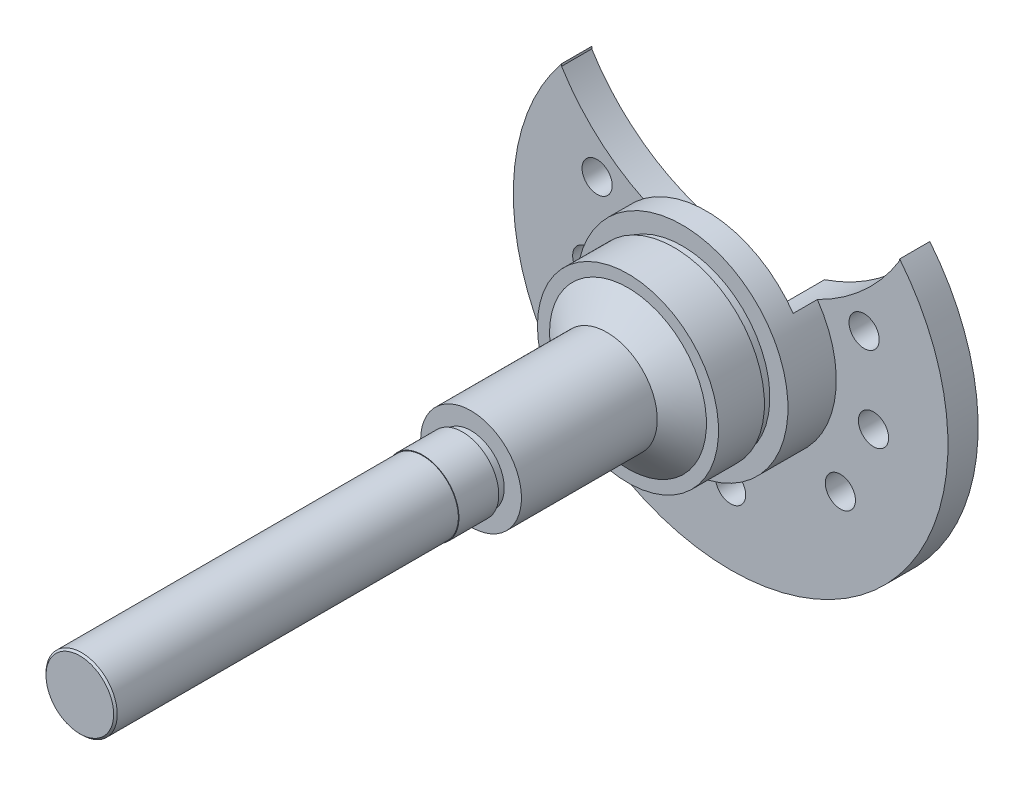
ISO-10303-21;
HEADER;
FILE_DESCRIPTION(('STEP AP214'),'2;1');
FILE_NAME('part.step','',(''),(''),'','','');
FILE_SCHEMA(('AUTOMOTIVE_DESIGN { 1 0 10303 214 1 1 1 1 }'));
ENDSEC;
DATA;
#1=APPLICATION_CONTEXT('core data for automotive mechanical design processes');
#2=APPLICATION_PROTOCOL_DEFINITION('international standard','automotive_design',2000,#1);
#3=PRODUCT_CONTEXT('',#1,'mechanical');
#4=PRODUCT('Part','Part','',(#3));
#5=PRODUCT_RELATED_PRODUCT_CATEGORY('part','',(#4));
#6=PRODUCT_DEFINITION_FORMATION('','',#4);
#7=PRODUCT_DEFINITION_CONTEXT('part definition',#1,'design');
#8=PRODUCT_DEFINITION('design','',#6,#7);
#9=PRODUCT_DEFINITION_SHAPE('','',#8);
#10=(LENGTH_UNIT() NAMED_UNIT(*) SI_UNIT(.MILLI.,.METRE.));
#11=(NAMED_UNIT(*) PLANE_ANGLE_UNIT() SI_UNIT($,.RADIAN.));
#12=(NAMED_UNIT(*) SI_UNIT($,.STERADIAN.) SOLID_ANGLE_UNIT());
#13=UNCERTAINTY_MEASURE_WITH_UNIT(LENGTH_MEASURE(1.E-05),#10,'distance_accuracy_value','');
#14=(GEOMETRIC_REPRESENTATION_CONTEXT(3) GLOBAL_UNCERTAINTY_ASSIGNED_CONTEXT((#13)) GLOBAL_UNIT_ASSIGNED_CONTEXT((#10,
#11,#12)) REPRESENTATION_CONTEXT('',''));
#15=CARTESIAN_POINT('',(0.,0.,0.));
#16=DIRECTION('',(0.,0.,1.));
#17=DIRECTION('',(1.,0.,0.));
#18=AXIS2_PLACEMENT_3D('',#15,#16,#17);
#19=CARTESIAN_POINT('',(0.,17.5,2.74228224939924));
#20=DIRECTION('',(0.,0.,1.));
#21=DIRECTION('',(1.,0.,0.));
#22=AXIS2_PLACEMENT_3D('',#19,#20,#21);
#23=PLANE('',#22);
#24=CARTESIAN_POINT('',(-22.1108319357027,9.33333333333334,2.74228224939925));
#25=DIRECTION('',(0.,0.,1.));
#26=DIRECTION('',(1.,0.,0.));
#27=AXIS2_PLACEMENT_3D('',#24,#25,#26);
#28=CIRCLE('',#27,2.5);
#29=CARTESIAN_POINT('',(-19.6108319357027,9.33333333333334,2.74228224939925));
#30=VERTEX_POINT('',#29);
#31=EDGE_CURVE('E640',#30,#30,#28,.F.);
#32=ORIENTED_EDGE('',*,*,#31,.T.);
#33=EDGE_LOOP('',(#32));
#34=FACE_BOUND('',#33,.T.);
#35=DIRECTION('',(0.,-1.,0.));
#36=VECTOR('',#35,1.);
#37=CARTESIAN_POINT('',(-28.,17.5,2.74228224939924));
#38=LINE('',#37,#36);
#39=CARTESIAN_POINT('',(-28.,22.6274169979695,2.74228224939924));
#40=VERTEX_POINT('',#39);
#41=CARTESIAN_POINT('',(-28.,22.2520496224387,2.74228224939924));
#42=VERTEX_POINT('',#41);
#43=EDGE_CURVE('E453',#40,#42,#38,.T.);
#44=ORIENTED_EDGE('',*,*,#43,.F.);
#45=CARTESIAN_POINT('',(0.,0.,2.74228224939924));
#46=DIRECTION('',(0.,0.,-1.));
#47=DIRECTION('',(-1.,0.,0.));
#48=AXIS2_PLACEMENT_3D('',#45,#46,#47);
#49=CIRCLE('',#48,36.);
#50=CARTESIAN_POINT('',(28.,22.6274169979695,2.74228224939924));
#51=VERTEX_POINT('',#50);
#52=EDGE_CURVE('E468',#51,#40,#49,.T.);
#53=ORIENTED_EDGE('',*,*,#52,.F.);
#54=DIRECTION('',(0.,1.,0.));
#55=VECTOR('',#54,1.);
#56=CARTESIAN_POINT('',(28.,17.5,2.74228224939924));
#57=LINE('',#56,#55);
#58=CARTESIAN_POINT('',(28.,22.3691298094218,2.74228224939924));
#59=VERTEX_POINT('',#58);
#60=EDGE_CURVE('E367',#59,#51,#57,.T.);
#61=ORIENTED_EDGE('',*,*,#60,.F.);
#62=CARTESIAN_POINT('',(-0.036039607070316,39.5485020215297,2.74228224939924));
#63=DIRECTION('',(0.,0.,1.));
#64=DIRECTION('',(1.,0.,0.));
#65=AXIS2_PLACEMENT_3D('',#62,#63,#64);
#66=CIRCLE('',#65,32.8808507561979);
#67=CARTESIAN_POINT('',(14.3679995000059,9.99052502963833,2.74228224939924));
#68=VERTEX_POINT('',#67);
#69=EDGE_CURVE('E422',#68,#59,#66,.T.);
#70=ORIENTED_EDGE('',*,*,#69,.F.);
#71=CARTESIAN_POINT('',(0.,0.,2.74228224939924));
#72=DIRECTION('',(0.,0.,-1.));
#73=DIRECTION('',(-1.,0.,0.));
#74=AXIS2_PLACEMENT_3D('',#71,#72,#73);
#75=CIRCLE('',#74,17.5);
#76=CARTESIAN_POINT('',(-14.3861838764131,9.96432202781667,2.74228224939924));
#77=VERTEX_POINT('',#76);
#78=EDGE_CURVE('E525',#68,#77,#75,.T.);
#79=ORIENTED_EDGE('',*,*,#78,.T.);
#80=EDGE_CURVE('E461',#42,#77,#66,.T.);
#81=ORIENTED_EDGE('',*,*,#80,.F.);
#82=EDGE_LOOP('',(#44,#53,#61,#70,#79,#81));
#83=FACE_BOUND('',#82,.T.);
#84=CARTESIAN_POINT('',(0.,-24.,2.74228224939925));
#85=DIRECTION('',(0.,0.,1.));
#86=DIRECTION('',(1.,0.,0.));
#87=AXIS2_PLACEMENT_3D('',#84,#85,#86);
#88=CIRCLE('',#87,2.5);
#89=CARTESIAN_POINT('',(2.5,-24.,2.74228224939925));
#90=VERTEX_POINT('',#89);
#91=EDGE_CURVE('E433',#90,#90,#88,.T.);
#92=ORIENTED_EDGE('',*,*,#91,.F.);
#93=EDGE_LOOP('',(#92));
#94=FACE_BOUND('',#93,.T.);
#95=CARTESIAN_POINT('',(18.1811868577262,-15.6666666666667,2.74228224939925));
#96=DIRECTION('',(0.,0.,1.));
#97=DIRECTION('',(1.,0.,0.));
#98=AXIS2_PLACEMENT_3D('',#95,#96,#97);
#99=CIRCLE('',#98,2.5);
#100=CARTESIAN_POINT('',(20.6811868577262,-15.6666666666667,2.74228224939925));
#101=VERTEX_POINT('',#100);
#102=EDGE_CURVE('E651',#101,#101,#99,.T.);
#103=ORIENTED_EDGE('',*,*,#102,.F.);
#104=EDGE_LOOP('',(#103));
#105=FACE_BOUND('',#104,.T.);
#106=CARTESIAN_POINT('',(22.1108319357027,9.33333333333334,2.74228224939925));
#107=DIRECTION('',(0.,0.,1.));
#108=DIRECTION('',(1.,0.,0.));
#109=AXIS2_PLACEMENT_3D('',#106,#107,#108);
#110=CIRCLE('',#109,2.5);
#111=CARTESIAN_POINT('',(24.6108319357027,9.33333333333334,2.74228224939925));
#112=VERTEX_POINT('',#111);
#113=EDGE_CURVE('E655',#112,#112,#110,.T.);
#114=ORIENTED_EDGE('',*,*,#113,.F.);
#115=EDGE_LOOP('',(#114));
#116=FACE_BOUND('',#115,.T.);
#117=CARTESIAN_POINT('',(23.6678311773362,-3.97916666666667,2.74228224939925));
#118=DIRECTION('',(0.,0.,1.));
#119=DIRECTION('',(1.,0.,0.));
#120=AXIS2_PLACEMENT_3D('',#117,#118,#119);
#121=CIRCLE('',#120,2.5);
#122=CARTESIAN_POINT('',(26.1678311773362,-3.97916666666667,2.74228224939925));
#123=VERTEX_POINT('',#122);
#124=EDGE_CURVE('E659',#123,#123,#121,.T.);
#125=ORIENTED_EDGE('',*,*,#124,.F.);
#126=EDGE_LOOP('',(#125));
#127=FACE_BOUND('',#126,.T.);
#128=CARTESIAN_POINT('',(-18.1811868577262,-15.6666666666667,2.74228224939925));
#129=DIRECTION('',(0.,0.,1.));
#130=DIRECTION('',(1.,0.,0.));
#131=AXIS2_PLACEMENT_3D('',#128,#129,#130);
#132=CIRCLE('',#131,2.5);
#133=CARTESIAN_POINT('',(-15.6811868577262,-15.6666666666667,2.74228224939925));
#134=VERTEX_POINT('',#133);
#135=EDGE_CURVE('E663',#134,#134,#132,.F.);
#136=ORIENTED_EDGE('',*,*,#135,.T.);
#137=EDGE_LOOP('',(#136));
#138=FACE_BOUND('',#137,.T.);
#139=CARTESIAN_POINT('',(-23.6678311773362,-3.97916666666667,2.74228224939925));
#140=DIRECTION('',(0.,0.,1.));
#141=DIRECTION('',(1.,0.,0.));
#142=AXIS2_PLACEMENT_3D('',#139,#140,#141);
#143=CIRCLE('',#142,2.5);
#144=CARTESIAN_POINT('',(-21.1678311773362,-3.97916666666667,2.74228224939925));
#145=VERTEX_POINT('',#144);
#146=EDGE_CURVE('E666',#145,#145,#143,.F.);
#147=ORIENTED_EDGE('',*,*,#146,.T.);
#148=EDGE_LOOP('',(#147));
#149=FACE_BOUND('',#148,.T.);
#150=ADVANCED_FACE('F353',(#34,#83,#94,#105,#116,#127,#138,#149),#23,.T.);
#151=CARTESIAN_POINT('',(0.,13.5,-2.25771775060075));
#152=DIRECTION('',(0.,0.,-1.));
#153=DIRECTION('',(-1.,0.,0.));
#154=AXIS2_PLACEMENT_3D('',#151,#152,#153);
#155=PLANE('',#154);
#156=CARTESIAN_POINT('',(-22.1108319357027,9.33333333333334,-2.25771775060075));
#157=DIRECTION('',(0.,0.,1.));
#158=DIRECTION('',(1.,0.,0.));
#159=AXIS2_PLACEMENT_3D('',#156,#157,#158);
#160=CIRCLE('',#159,2.5);
#161=CARTESIAN_POINT('',(-19.6108319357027,9.33333333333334,-2.25771775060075));
#162=VERTEX_POINT('',#161);
#163=EDGE_CURVE('E668',#162,#162,#160,.T.);
#164=ORIENTED_EDGE('',*,*,#163,.T.);
#165=EDGE_LOOP('',(#164));
#166=FACE_BOUND('',#165,.T.);
#167=DIRECTION('',(0.,1.,0.));
#168=VECTOR('',#167,1.);
#169=CARTESIAN_POINT('',(-28.,38.0000000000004,-2.25771775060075));
#170=LINE('',#169,#168);
#171=CARTESIAN_POINT('',(-28.,22.2520496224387,-2.25771775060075));
#172=VERTEX_POINT('',#171);
#173=CARTESIAN_POINT('',(-28.,22.6274169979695,-2.25771775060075));
#174=VERTEX_POINT('',#173);
#175=EDGE_CURVE('E442',#172,#174,#170,.T.);
#176=ORIENTED_EDGE('',*,*,#175,.F.);
#177=CARTESIAN_POINT('',(-0.036039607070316,39.5485020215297,-2.25771775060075));
#178=DIRECTION('',(0.,0.,-1.));
#179=DIRECTION('',(-1.,0.,0.));
#180=AXIS2_PLACEMENT_3D('',#177,#178,#179);
#181=CIRCLE('',#180,32.8808507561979);
#182=CARTESIAN_POINT('',(-10.5682647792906,8.40010592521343,-2.25771775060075));
#183=VERTEX_POINT('',#182);
#184=EDGE_CURVE('E432',#183,#172,#181,.T.);
#185=ORIENTED_EDGE('',*,*,#184,.F.);
#186=CARTESIAN_POINT('',(0.,0.,-2.25771775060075));
#187=DIRECTION('',(0.,0.,-1.));
#188=DIRECTION('',(-1.,0.,0.));
#189=AXIS2_PLACEMENT_3D('',#186,#187,#188);
#190=CIRCLE('',#189,13.5);
#191=CARTESIAN_POINT('',(10.5529376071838,8.41935317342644,-2.25771775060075));
#192=VERTEX_POINT('',#191);
#193=EDGE_CURVE('E441',#192,#183,#190,.T.);
#194=ORIENTED_EDGE('',*,*,#193,.F.);
#195=CARTESIAN_POINT('',(28.,22.3691298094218,-2.25771775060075));
#196=VERTEX_POINT('',#195);
#197=EDGE_CURVE('E419',#196,#192,#181,.T.);
#198=ORIENTED_EDGE('',*,*,#197,.F.);
#199=DIRECTION('',(0.,-1.,0.));
#200=VECTOR('',#199,1.);
#201=CARTESIAN_POINT('',(28.,38.0000000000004,-2.25771775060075));
#202=LINE('',#201,#200);
#203=CARTESIAN_POINT('',(28.,22.6274169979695,-2.25771775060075));
#204=VERTEX_POINT('',#203);
#205=EDGE_CURVE('E427',#204,#196,#202,.T.);
#206=ORIENTED_EDGE('',*,*,#205,.F.);
#207=CARTESIAN_POINT('',(0.,0.,-2.25771775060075));
#208=DIRECTION('',(0.,0.,-1.));
#209=DIRECTION('',(-1.,0.,0.));
#210=AXIS2_PLACEMENT_3D('',#207,#208,#209);
#211=CIRCLE('',#210,36.);
#212=EDGE_CURVE('E471',#204,#174,#211,.T.);
#213=ORIENTED_EDGE('',*,*,#212,.T.);
#214=EDGE_LOOP('',(#176,#185,#194,#198,#206,#213));
#215=FACE_BOUND('',#214,.T.);
#216=CARTESIAN_POINT('',(0.,-24.,-2.25771775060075));
#217=DIRECTION('',(0.,0.,-1.));
#218=DIRECTION('',(-1.,0.,0.));
#219=AXIS2_PLACEMENT_3D('',#216,#217,#218);
#220=CIRCLE('',#219,2.5);
#221=CARTESIAN_POINT('',(-2.5,-24.,-2.25771775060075));
#222=VERTEX_POINT('',#221);
#223=EDGE_CURVE('E693',#222,#222,#220,.T.);
#224=ORIENTED_EDGE('',*,*,#223,.F.);
#225=EDGE_LOOP('',(#224));
#226=FACE_BOUND('',#225,.T.);
#227=CARTESIAN_POINT('',(18.1811868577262,-15.6666666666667,-2.25771775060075));
#228=DIRECTION('',(0.,0.,-1.));
#229=DIRECTION('',(-1.,0.,0.));
#230=AXIS2_PLACEMENT_3D('',#227,#228,#229);
#231=CIRCLE('',#230,2.5);
#232=CARTESIAN_POINT('',(15.6811868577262,-15.6666666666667,-2.25771775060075));
#233=VERTEX_POINT('',#232);
#234=EDGE_CURVE('E689',#233,#233,#231,.T.);
#235=ORIENTED_EDGE('',*,*,#234,.F.);
#236=EDGE_LOOP('',(#235));
#237=FACE_BOUND('',#236,.T.);
#238=CARTESIAN_POINT('',(22.1108319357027,9.33333333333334,-2.25771775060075));
#239=DIRECTION('',(0.,0.,-1.));
#240=DIRECTION('',(-1.,0.,0.));
#241=AXIS2_PLACEMENT_3D('',#238,#239,#240);
#242=CIRCLE('',#241,2.5);
#243=CARTESIAN_POINT('',(19.6108319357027,9.33333333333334,-2.25771775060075));
#244=VERTEX_POINT('',#243);
#245=EDGE_CURVE('E685',#244,#244,#242,.T.);
#246=ORIENTED_EDGE('',*,*,#245,.F.);
#247=EDGE_LOOP('',(#246));
#248=FACE_BOUND('',#247,.T.);
#249=CARTESIAN_POINT('',(23.6678311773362,-3.97916666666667,-2.25771775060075));
#250=DIRECTION('',(0.,0.,-1.));
#251=DIRECTION('',(-1.,0.,0.));
#252=AXIS2_PLACEMENT_3D('',#249,#250,#251);
#253=CIRCLE('',#252,2.5);
#254=CARTESIAN_POINT('',(21.1678311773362,-3.97916666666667,-2.25771775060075));
#255=VERTEX_POINT('',#254);
#256=EDGE_CURVE('E681',#255,#255,#253,.T.);
#257=ORIENTED_EDGE('',*,*,#256,.F.);
#258=EDGE_LOOP('',(#257));
#259=FACE_BOUND('',#258,.T.);
#260=CARTESIAN_POINT('',(-18.1811868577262,-15.6666666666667,-2.25771775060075));
#261=DIRECTION('',(0.,0.,1.));
#262=DIRECTION('',(1.,0.,0.));
#263=AXIS2_PLACEMENT_3D('',#260,#261,#262);
#264=CIRCLE('',#263,2.5);
#265=CARTESIAN_POINT('',(-15.6811868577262,-15.6666666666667,-2.25771775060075));
#266=VERTEX_POINT('',#265);
#267=EDGE_CURVE('E677',#266,#266,#264,.T.);
#268=ORIENTED_EDGE('',*,*,#267,.T.);
#269=EDGE_LOOP('',(#268));
#270=FACE_BOUND('',#269,.T.);
#271=CARTESIAN_POINT('',(-23.6678311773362,-3.97916666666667,-2.25771775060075));
#272=DIRECTION('',(0.,0.,1.));
#273=DIRECTION('',(1.,0.,0.));
#274=AXIS2_PLACEMENT_3D('',#271,#272,#273);
#275=CIRCLE('',#274,2.5);
#276=CARTESIAN_POINT('',(-21.1678311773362,-3.97916666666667,-2.25771775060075));
#277=VERTEX_POINT('',#276);
#278=EDGE_CURVE('E669',#277,#277,#275,.T.);
#279=ORIENTED_EDGE('',*,*,#278,.T.);
#280=EDGE_LOOP('',(#279));
#281=FACE_BOUND('',#280,.T.);
#282=ADVANCED_FACE('F437',(#166,#215,#226,#237,#248,#259,#270,#281),#155,.T.);
#283=CARTESIAN_POINT('',(0.,0.,-4.34296339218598));
#284=DIRECTION('',(0.,0.,-1.));
#285=DIRECTION('',(-1.,0.,0.));
#286=AXIS2_PLACEMENT_3D('',#283,#284,#285);
#287=CYLINDRICAL_SURFACE('',#286,17.5);
#288=DIRECTION('',(0.,0.,-1.));
#289=VECTOR('',#288,1.);
#290=CARTESIAN_POINT('',(14.3679995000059,9.99052502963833,4.74228224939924));
#291=LINE('',#290,#289);
#292=CARTESIAN_POINT('',(14.3679995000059,9.99052502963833,6.74228224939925));
#293=VERTEX_POINT('',#292);
#294=EDGE_CURVE('E463',#293,#68,#291,.T.);
#295=ORIENTED_EDGE('',*,*,#294,.F.);
#296=CARTESIAN_POINT('',(0.,0.,6.74228224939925));
#297=DIRECTION('',(0.,0.,-1.));
#298=DIRECTION('',(-1.,0.,0.));
#299=AXIS2_PLACEMENT_3D('',#296,#297,#298);
#300=CIRCLE('',#299,17.5);
#301=CARTESIAN_POINT('',(-14.3861838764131,9.96432202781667,6.74228224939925));
#302=VERTEX_POINT('',#301);
#303=EDGE_CURVE('E465',#293,#302,#300,.F.);
#304=ORIENTED_EDGE('',*,*,#303,.T.);
#305=DIRECTION('',(0.,0.,-1.));
#306=VECTOR('',#305,1.);
#307=CARTESIAN_POINT('',(-14.3861838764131,9.96432202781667,4.74228224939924));
#308=LINE('',#307,#306);
#309=EDGE_CURVE('E459',#77,#302,#308,.F.);
#310=ORIENTED_EDGE('',*,*,#309,.F.);
#311=ORIENTED_EDGE('',*,*,#78,.F.);
#312=EDGE_LOOP('',(#295,#304,#310,#311));
#313=FACE_BOUND('',#312,.T.);
#314=CARTESIAN_POINT('',(0.,0.,10.7422822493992));
#315=DIRECTION('',(0.,0.,-1.));
#316=DIRECTION('',(-1.,0.,0.));
#317=AXIS2_PLACEMENT_3D('',#314,#315,#316);
#318=CIRCLE('',#317,17.5);
#319=CARTESIAN_POINT('',(-17.5,0.,10.7422822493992));
#320=VERTEX_POINT('',#319);
#321=EDGE_CURVE('E522',#320,#320,#318,.T.);
#322=ORIENTED_EDGE('',*,*,#321,.T.);
#323=EDGE_LOOP('',(#322));
#324=FACE_BOUND('',#323,.T.);
#325=ADVANCED_FACE('F619',(#313,#324),#287,.T.);
#326=CARTESIAN_POINT('',(0.,17.5,10.7422822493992));
#327=DIRECTION('',(0.,0.,1.));
#328=DIRECTION('',(1.,0.,0.));
#329=AXIS2_PLACEMENT_3D('',#326,#327,#328);
#330=PLANE('',#329);
#331=CARTESIAN_POINT('',(0.,0.,10.7422822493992));
#332=DIRECTION('',(0.,0.,-1.));
#333=DIRECTION('',(-1.,0.,0.));
#334=AXIS2_PLACEMENT_3D('',#331,#332,#333);
#335=CIRCLE('',#334,14.5018230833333);
#336=CARTESIAN_POINT('',(-14.5018230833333,0.,10.7422822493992));
#337=VERTEX_POINT('',#336);
#338=EDGE_CURVE('E519',#337,#337,#335,.T.);
#339=ORIENTED_EDGE('',*,*,#338,.T.);
#340=EDGE_LOOP('',(#339));
#341=FACE_BOUND('',#340,.T.);
#342=ORIENTED_EDGE('',*,*,#321,.F.);
#343=EDGE_LOOP('',(#342));
#344=FACE_BOUND('',#343,.T.);
#345=ADVANCED_FACE('F613',(#341,#344),#330,.T.);
#346=CARTESIAN_POINT('',(0.,0.,-4.34296339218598));
#347=DIRECTION('',(0.,0.,-1.));
#348=DIRECTION('',(-1.,0.,0.));
#349=AXIS2_PLACEMENT_3D('',#346,#347,#348);
#350=CYLINDRICAL_SURFACE('',#349,14.5018230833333);
#351=CARTESIAN_POINT('',(0.,0.,12.1422822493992));
#352=DIRECTION('',(0.,0.,-1.));
#353=DIRECTION('',(-1.,0.,0.));
#354=AXIS2_PLACEMENT_3D('',#351,#352,#353);
#355=CIRCLE('',#354,14.5018230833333);
#356=CARTESIAN_POINT('',(-14.5018230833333,0.,12.1422822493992));
#357=VERTEX_POINT('',#356);
#358=EDGE_CURVE('E516',#357,#357,#355,.T.);
#359=ORIENTED_EDGE('',*,*,#358,.T.);
#360=EDGE_LOOP('',(#359));
#361=FACE_BOUND('',#360,.T.);
#362=ORIENTED_EDGE('',*,*,#338,.F.);
#363=EDGE_LOOP('',(#362));
#364=FACE_BOUND('',#363,.T.);
#365=ADVANCED_FACE('F607',(#361,#364),#350,.T.);
#366=CARTESIAN_POINT('',(0.,15.,12.1422822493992));
#367=DIRECTION('',(0.,0.,-1.));
#368=DIRECTION('',(-1.,0.,0.));
#369=AXIS2_PLACEMENT_3D('',#366,#367,#368);
#370=PLANE('',#369);
#371=CARTESIAN_POINT('',(0.,0.,12.1422822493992));
#372=DIRECTION('',(0.,0.,-1.));
#373=DIRECTION('',(-1.,0.,0.));
#374=AXIS2_PLACEMENT_3D('',#371,#372,#373);
#375=CIRCLE('',#374,15.);
#376=CARTESIAN_POINT('',(-15.,0.,12.1422822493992));
#377=VERTEX_POINT('',#376);
#378=EDGE_CURVE('E513',#377,#377,#375,.T.);
#379=ORIENTED_EDGE('',*,*,#378,.T.);
#380=EDGE_LOOP('',(#379));
#381=FACE_BOUND('',#380,.T.);
#382=ORIENTED_EDGE('',*,*,#358,.F.);
#383=EDGE_LOOP('',(#382));
#384=FACE_BOUND('',#383,.T.);
#385=ADVANCED_FACE('F601',(#381,#384),#370,.T.);
#386=CARTESIAN_POINT('',(0.,0.,-4.34296339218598));
#387=DIRECTION('',(0.,0.,-1.));
#388=DIRECTION('',(-1.,0.,0.));
#389=AXIS2_PLACEMENT_3D('',#386,#387,#388);
#390=CYLINDRICAL_SURFACE('',#389,15.);
#391=CARTESIAN_POINT('',(0.,0.,19.7422822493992));
#392=DIRECTION('',(0.,0.,-1.));
#393=DIRECTION('',(-1.,0.,0.));
#394=AXIS2_PLACEMENT_3D('',#391,#392,#393);
#395=CIRCLE('',#394,15.);
#396=CARTESIAN_POINT('',(-15.,0.,19.7422822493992));
#397=VERTEX_POINT('',#396);
#398=EDGE_CURVE('E510',#397,#397,#395,.T.);
#399=ORIENTED_EDGE('',*,*,#398,.T.);
#400=EDGE_LOOP('',(#399));
#401=FACE_BOUND('',#400,.T.);
#402=ORIENTED_EDGE('',*,*,#378,.F.);
#403=EDGE_LOOP('',(#402));
#404=FACE_BOUND('',#403,.T.);
#405=ADVANCED_FACE('F595',(#401,#404),#390,.T.);
#406=CARTESIAN_POINT('',(0.,15.,19.7422822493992));
#407=DIRECTION('',(0.,0.,1.));
#408=DIRECTION('',(1.,0.,0.));
#409=AXIS2_PLACEMENT_3D('',#406,#407,#408);
#410=PLANE('',#409);
#411=CARTESIAN_POINT('',(0.,0.,19.7422822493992));
#412=DIRECTION('',(0.,0.,-1.));
#413=DIRECTION('',(-1.,0.,0.));
#414=AXIS2_PLACEMENT_3D('',#411,#412,#413);
#415=CIRCLE('',#414,13.);
#416=CARTESIAN_POINT('',(-13.,0.,19.7422822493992));
#417=VERTEX_POINT('',#416);
#418=EDGE_CURVE('E507',#417,#417,#415,.T.);
#419=ORIENTED_EDGE('',*,*,#418,.T.);
#420=EDGE_LOOP('',(#419));
#421=FACE_BOUND('',#420,.T.);
#422=ORIENTED_EDGE('',*,*,#398,.F.);
#423=EDGE_LOOP('',(#422));
#424=FACE_BOUND('',#423,.T.);
#425=ADVANCED_FACE('F589',(#421,#424),#410,.T.);
#426=CARTESIAN_POINT('',(0.,0.,19.7422822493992));
#427=DIRECTION('',(0.,0.,-1.));
#428=DIRECTION('',(-1.,0.,0.));
#429=AXIS2_PLACEMENT_3D('',#426,#427,#428);
#430=CONICAL_SURFACE('',#429,13.,0.925577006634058);
#431=CARTESIAN_POINT('',(0.,0.,23.2422822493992));
#432=DIRECTION('',(0.,0.,-1.));
#433=DIRECTION('',(-1.,0.,0.));
#434=AXIS2_PLACEMENT_3D('',#431,#432,#433);
#435=CIRCLE('',#434,8.35);
#436=CARTESIAN_POINT('',(-8.35,0.,23.2422822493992));
#437=VERTEX_POINT('',#436);
#438=EDGE_CURVE('E504',#437,#437,#435,.T.);
#439=ORIENTED_EDGE('',*,*,#438,.T.);
#440=EDGE_LOOP('',(#439));
#441=FACE_BOUND('',#440,.T.);
#442=ORIENTED_EDGE('',*,*,#418,.F.);
#443=EDGE_LOOP('',(#442));
#444=FACE_BOUND('',#443,.T.);
#445=ADVANCED_FACE('F583',(#441,#444),#430,.T.);
#446=CARTESIAN_POINT('',(0.,0.,-4.34296339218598));
#447=DIRECTION('',(0.,0.,-1.));
#448=DIRECTION('',(-1.,0.,0.));
#449=AXIS2_PLACEMENT_3D('',#446,#447,#448);
#450=CYLINDRICAL_SURFACE('',#449,8.35);
#451=CARTESIAN_POINT('',(0.,0.,45.7422822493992));
#452=DIRECTION('',(0.,0.,-1.));
#453=DIRECTION('',(-1.,0.,0.));
#454=AXIS2_PLACEMENT_3D('',#451,#452,#453);
#455=CIRCLE('',#454,8.35);
#456=CARTESIAN_POINT('',(-8.35,0.,45.7422822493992));
#457=VERTEX_POINT('',#456);
#458=EDGE_CURVE('E501',#457,#457,#455,.T.);
#459=ORIENTED_EDGE('',*,*,#458,.T.);
#460=EDGE_LOOP('',(#459));
#461=FACE_BOUND('',#460,.T.);
#462=ORIENTED_EDGE('',*,*,#438,.F.);
#463=EDGE_LOOP('',(#462));
#464=FACE_BOUND('',#463,.T.);
#465=ADVANCED_FACE('F577',(#461,#464),#450,.T.);
#466=CARTESIAN_POINT('',(0.,6.,45.7422822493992));
#467=DIRECTION('',(0.,0.,1.));
#468=DIRECTION('',(1.,0.,0.));
#469=AXIS2_PLACEMENT_3D('',#466,#467,#468);
#470=PLANE('',#469);
#471=CARTESIAN_POINT('',(0.,0.,45.7422822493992));
#472=DIRECTION('',(0.,0.,-1.));
#473=DIRECTION('',(-1.,0.,0.));
#474=AXIS2_PLACEMENT_3D('',#471,#472,#473);
#475=CIRCLE('',#474,5.5);
#476=CARTESIAN_POINT('',(-5.5,0.,45.7422822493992));
#477=VERTEX_POINT('',#476);
#478=EDGE_CURVE('E498',#477,#477,#475,.T.);
#479=ORIENTED_EDGE('',*,*,#478,.T.);
#480=EDGE_LOOP('',(#479));
#481=FACE_BOUND('',#480,.T.);
#482=ORIENTED_EDGE('',*,*,#458,.F.);
#483=EDGE_LOOP('',(#482));
#484=FACE_BOUND('',#483,.T.);
#485=ADVANCED_FACE('F571',(#481,#484),#470,.T.);
#486=CARTESIAN_POINT('',(0.,0.,-4.34296339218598));
#487=DIRECTION('',(0.,0.,-1.));
#488=DIRECTION('',(-1.,0.,0.));
#489=AXIS2_PLACEMENT_3D('',#486,#487,#488);
#490=CYLINDRICAL_SURFACE('',#489,5.5);
#491=CARTESIAN_POINT('',(0.,0.,47.1422822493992));
#492=DIRECTION('',(0.,0.,-1.));
#493=DIRECTION('',(-1.,0.,0.));
#494=AXIS2_PLACEMENT_3D('',#491,#492,#493);
#495=CIRCLE('',#494,5.5);
#496=CARTESIAN_POINT('',(-5.5,0.,47.1422822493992));
#497=VERTEX_POINT('',#496);
#498=EDGE_CURVE('E495',#497,#497,#495,.T.);
#499=ORIENTED_EDGE('',*,*,#498,.T.);
#500=EDGE_LOOP('',(#499));
#501=FACE_BOUND('',#500,.T.);
#502=ORIENTED_EDGE('',*,*,#478,.F.);
#503=EDGE_LOOP('',(#502));
#504=FACE_BOUND('',#503,.T.);
#505=ADVANCED_FACE('F565',(#501,#504),#490,.T.);
#506=CARTESIAN_POINT('',(0.,5.5,47.1422822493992));
#507=DIRECTION('',(0.,0.,-1.));
#508=DIRECTION('',(-1.,0.,0.));
#509=AXIS2_PLACEMENT_3D('',#506,#507,#508);
#510=PLANE('',#509);
#511=CARTESIAN_POINT('',(0.,0.,47.1422822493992));
#512=DIRECTION('',(0.,0.,-1.));
#513=DIRECTION('',(-1.,0.,0.));
#514=AXIS2_PLACEMENT_3D('',#511,#512,#513);
#515=CIRCLE('',#514,6.);
#516=CARTESIAN_POINT('',(-6.,0.,47.1422822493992));
#517=VERTEX_POINT('',#516);
#518=EDGE_CURVE('E492',#517,#517,#515,.T.);
#519=ORIENTED_EDGE('',*,*,#518,.T.);
#520=EDGE_LOOP('',(#519));
#521=FACE_BOUND('',#520,.T.);
#522=ORIENTED_EDGE('',*,*,#498,.F.);
#523=EDGE_LOOP('',(#522));
#524=FACE_BOUND('',#523,.T.);
#525=ADVANCED_FACE('F559',(#521,#524),#510,.T.);
#526=CARTESIAN_POINT('',(0.,0.,-4.34296339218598));
#527=DIRECTION('',(0.,0.,-1.));
#528=DIRECTION('',(-1.,0.,0.));
#529=AXIS2_PLACEMENT_3D('',#526,#527,#528);
#530=CYLINDRICAL_SURFACE('',#529,6.);
#531=CARTESIAN_POINT('',(0.,0.,53.7422822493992));
#532=DIRECTION('',(0.,0.,-1.));
#533=DIRECTION('',(-1.,0.,0.));
#534=AXIS2_PLACEMENT_3D('',#531,#532,#533);
#535=CIRCLE('',#534,6.);
#536=CARTESIAN_POINT('',(-6.,0.,53.7422822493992));
#537=VERTEX_POINT('',#536);
#538=EDGE_CURVE('E489',#537,#537,#535,.T.);
#539=ORIENTED_EDGE('',*,*,#538,.T.);
#540=EDGE_LOOP('',(#539));
#541=FACE_BOUND('',#540,.T.);
#542=ORIENTED_EDGE('',*,*,#518,.F.);
#543=EDGE_LOOP('',(#542));
#544=FACE_BOUND('',#543,.T.);
#545=ADVANCED_FACE('F553',(#541,#544),#530,.T.);
#546=CARTESIAN_POINT('',(0.,6.,53.7422822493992));
#547=DIRECTION('',(0.,0.,1.));
#548=DIRECTION('',(1.,0.,0.));
#549=AXIS2_PLACEMENT_3D('',#546,#547,#548);
#550=PLANE('',#549);
#551=CARTESIAN_POINT('',(0.,0.,53.7422822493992));
#552=DIRECTION('',(0.,0.,-1.));
#553=DIRECTION('',(-1.,0.,0.));
#554=AXIS2_PLACEMENT_3D('',#551,#552,#553);
#555=CIRCLE('',#554,5.89999999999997);
#556=CARTESIAN_POINT('',(-5.89999999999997,0.,53.7422822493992));
#557=VERTEX_POINT('',#556);
#558=EDGE_CURVE('E486',#557,#557,#555,.T.);
#559=ORIENTED_EDGE('',*,*,#558,.T.);
#560=EDGE_LOOP('',(#559));
#561=FACE_BOUND('',#560,.T.);
#562=ORIENTED_EDGE('',*,*,#538,.F.);
#563=EDGE_LOOP('',(#562));
#564=FACE_BOUND('',#563,.T.);
#565=ADVANCED_FACE('F547',(#561,#564),#550,.T.);
#566=CARTESIAN_POINT('',(0.,0.,-4.34296339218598));
#567=DIRECTION('',(0.,0.,-1.));
#568=DIRECTION('',(-1.,0.,0.));
#569=AXIS2_PLACEMENT_3D('',#566,#567,#568);
#570=CYLINDRICAL_SURFACE('',#569,5.89999999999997);
#571=CARTESIAN_POINT('',(0.,0.,110.242282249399));
#572=DIRECTION('',(0.,0.,1.));
#573=DIRECTION('',(1.,0.,0.));
#574=AXIS2_PLACEMENT_3D('',#571,#572,#573);
#575=CIRCLE('',#574,5.89999999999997);
#576=CARTESIAN_POINT('',(5.89999999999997,0.,110.242282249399));
#577=VERTEX_POINT('',#576);
#578=EDGE_CURVE('E528',#577,#577,#575,.F.);
#579=ORIENTED_EDGE('',*,*,#578,.T.);
#580=EDGE_LOOP('',(#579));
#581=FACE_BOUND('',#580,.T.);
#582=ORIENTED_EDGE('',*,*,#558,.F.);
#583=EDGE_LOOP('',(#582));
#584=FACE_BOUND('',#583,.T.);
#585=ADVANCED_FACE('F544',(#581,#584),#570,.T.);
#586=CARTESIAN_POINT('',(0.,5.89999999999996,110.542282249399));
#587=DIRECTION('',(0.,0.,1.));
#588=DIRECTION('',(1.,0.,0.));
#589=AXIS2_PLACEMENT_3D('',#586,#587,#588);
#590=PLANE('',#589);
#591=CARTESIAN_POINT('',(0.,0.,110.542282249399));
#592=DIRECTION('',(0.,0.,1.));
#593=DIRECTION('',(1.,0.,0.));
#594=AXIS2_PLACEMENT_3D('',#591,#592,#593);
#595=CIRCLE('',#594,5.59999999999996);
#596=CARTESIAN_POINT('',(5.59999999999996,0.,110.542282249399));
#597=VERTEX_POINT('',#596);
#598=EDGE_CURVE('E531',#597,#597,#595,.T.);
#599=ORIENTED_EDGE('',*,*,#598,.T.);
#600=EDGE_LOOP('',(#599));
#601=FACE_BOUND('',#600,.T.);
#602=ADVANCED_FACE('F535',(#601),#590,.T.);
#603=CARTESIAN_POINT('',(0.,0.,22.));
#604=DIRECTION('',(0.,0.,-1.));
#605=DIRECTION('',(-1.,0.,0.));
#606=AXIS2_PLACEMENT_3D('',#603,#604,#605);
#607=CONICAL_SURFACE('',#606,0.,1.1491899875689);
#608=CARTESIAN_POINT('',(0.,0.,19.));
#609=DIRECTION('',(0.,0.,-1.));
#610=DIRECTION('',(-1.,0.,0.));
#611=AXIS2_PLACEMENT_3D('',#608,#609,#610);
#612=CIRCLE('',#611,6.68895399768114);
#613=CARTESIAN_POINT('',(-6.68895399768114,0.,19.));
#614=VERTEX_POINT('',#613);
#615=EDGE_CURVE('E483',#614,#614,#612,.T.);
#616=ORIENTED_EDGE('',*,*,#615,.T.);
#617=EDGE_LOOP('',(#616));
#618=FACE_BOUND('',#617,.T.);
#619=CARTESIAN_POINT('',(0.,0.,22.));
#620=VERTEX_POINT('',#619);
#621=VERTEX_LOOP('',#620);
#622=FACE_BOUND('',#621,.T.);
#623=ADVANCED_FACE('F764',(#618,#622),#607,.F.);
#624=CARTESIAN_POINT('',(0.,10.5,19.));
#625=DIRECTION('',(0.,0.,-1.));
#626=DIRECTION('',(-1.,0.,0.));
#627=AXIS2_PLACEMENT_3D('',#624,#625,#626);
#628=PLANE('',#627);
#629=CARTESIAN_POINT('',(0.,0.,19.));
#630=DIRECTION('',(0.,0.,-1.));
#631=DIRECTION('',(-1.,0.,0.));
#632=AXIS2_PLACEMENT_3D('',#629,#630,#631);
#633=CIRCLE('',#632,10.5);
#634=CARTESIAN_POINT('',(-10.5,0.,19.));
#635=VERTEX_POINT('',#634);
#636=EDGE_CURVE('E480',#635,#635,#633,.T.);
#637=ORIENTED_EDGE('',*,*,#636,.T.);
#638=EDGE_LOOP('',(#637));
#639=FACE_BOUND('',#638,.T.);
#640=ORIENTED_EDGE('',*,*,#615,.F.);
#641=EDGE_LOOP('',(#640));
#642=FACE_BOUND('',#641,.T.);
#643=ADVANCED_FACE('F760',(#639,#642),#628,.T.);
#644=CARTESIAN_POINT('',(0.,0.,-4.34296339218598));
#645=DIRECTION('',(0.,0.,-1.));
#646=DIRECTION('',(-1.,0.,0.));
#647=AXIS2_PLACEMENT_3D('',#644,#645,#646);
#648=CYLINDRICAL_SURFACE('',#647,10.5);
#649=CARTESIAN_POINT('',(0.,0.,6.74228224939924));
#650=DIRECTION('',(0.,0.,-1.));
#651=DIRECTION('',(-1.,0.,0.));
#652=AXIS2_PLACEMENT_3D('',#649,#650,#651);
#653=CIRCLE('',#652,10.5);
#654=CARTESIAN_POINT('',(-10.5,0.,6.74228224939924));
#655=VERTEX_POINT('',#654);
#656=EDGE_CURVE('E477',#655,#655,#653,.T.);
#657=ORIENTED_EDGE('',*,*,#656,.T.);
#658=EDGE_LOOP('',(#657));
#659=FACE_BOUND('',#658,.T.);
#660=ORIENTED_EDGE('',*,*,#636,.F.);
#661=EDGE_LOOP('',(#660));
#662=FACE_BOUND('',#661,.T.);
#663=ADVANCED_FACE('F757',(#659,#662),#648,.F.);
#664=CARTESIAN_POINT('',(0.,13.5,6.74228224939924));
#665=DIRECTION('',(0.,0.,-1.));
#666=DIRECTION('',(-1.,0.,0.));
#667=AXIS2_PLACEMENT_3D('',#664,#665,#666);
#668=PLANE('',#667);
#669=ORIENTED_EDGE('',*,*,#656,.F.);
#670=EDGE_LOOP('',(#669));
#671=FACE_BOUND('',#670,.T.);
#672=CARTESIAN_POINT('',(-0.036039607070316,39.5485020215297,6.74228224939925));
#673=DIRECTION('',(0.,0.,-1.));
#674=DIRECTION('',(-1.,0.,0.));
#675=AXIS2_PLACEMENT_3D('',#672,#673,#674);
#676=CIRCLE('',#675,32.8808507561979);
#677=CARTESIAN_POINT('',(10.5529376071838,8.41935317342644,6.74228224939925));
#678=VERTEX_POINT('',#677);
#679=EDGE_CURVE('E424',#293,#678,#676,.T.);
#680=ORIENTED_EDGE('',*,*,#679,.T.);
#681=CARTESIAN_POINT('',(0.,0.,6.74228224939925));
#682=DIRECTION('',(0.,0.,-1.));
#683=DIRECTION('',(-1.,0.,0.));
#684=AXIS2_PLACEMENT_3D('',#681,#682,#683);
#685=CIRCLE('',#684,13.5);
#686=CARTESIAN_POINT('',(-10.5682647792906,8.40010592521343,6.74228224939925));
#687=VERTEX_POINT('',#686);
#688=EDGE_CURVE('E474',#678,#687,#685,.T.);
#689=ORIENTED_EDGE('',*,*,#688,.T.);
#690=EDGE_CURVE('E444',#687,#302,#676,.T.);
#691=ORIENTED_EDGE('',*,*,#690,.T.);
#692=ORIENTED_EDGE('',*,*,#303,.F.);
#693=EDGE_LOOP('',(#680,#689,#691,#692));
#694=FACE_BOUND('',#693,.T.);
#695=ADVANCED_FACE('F753',(#671,#694),#668,.T.);
#696=CARTESIAN_POINT('',(0.,0.,-4.34296339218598));
#697=DIRECTION('',(0.,0.,-1.));
#698=DIRECTION('',(-1.,0.,0.));
#699=AXIS2_PLACEMENT_3D('',#696,#697,#698);
#700=CYLINDRICAL_SURFACE('',#699,13.5);
#701=DIRECTION('',(0.,0.,-1.));
#702=VECTOR('',#701,1.);
#703=CARTESIAN_POINT('',(10.5529376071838,8.41935317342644,2.24228224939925));
#704=LINE('',#703,#702);
#705=EDGE_CURVE('E457',#192,#678,#704,.F.);
#706=ORIENTED_EDGE('',*,*,#705,.F.);
#707=ORIENTED_EDGE('',*,*,#193,.T.);
#708=DIRECTION('',(0.,0.,-1.));
#709=VECTOR('',#708,1.);
#710=CARTESIAN_POINT('',(-10.5682647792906,8.40010592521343,2.24228224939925));
#711=LINE('',#710,#709);
#712=EDGE_CURVE('E455',#687,#183,#711,.T.);
#713=ORIENTED_EDGE('',*,*,#712,.F.);
#714=ORIENTED_EDGE('',*,*,#688,.F.);
#715=EDGE_LOOP('',(#706,#707,#713,#714));
#716=FACE_BOUND('',#715,.T.);
#717=ADVANCED_FACE('F748',(#716),#700,.F.);
#718=CARTESIAN_POINT('',(0.,0.,-4.34296339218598));
#719=DIRECTION('',(0.,0.,-1.));
#720=DIRECTION('',(-1.,0.,0.));
#721=AXIS2_PLACEMENT_3D('',#718,#719,#720);
#722=CYLINDRICAL_SURFACE('',#721,36.);
#723=DIRECTION('',(0.,0.,-1.));
#724=VECTOR('',#723,1.);
#725=CARTESIAN_POINT('',(-28.,22.6274169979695,-4.34296339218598));
#726=LINE('',#725,#724);
#727=EDGE_CURVE('E11',#174,#40,#726,.F.);
#728=ORIENTED_EDGE('',*,*,#727,.F.);
#729=ORIENTED_EDGE('',*,*,#212,.F.);
#730=DIRECTION('',(0.,0.,-1.));
#731=VECTOR('',#730,1.);
#732=CARTESIAN_POINT('',(28.,22.6274169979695,-4.34296339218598));
#733=LINE('',#732,#731);
#734=EDGE_CURVE('E360',#51,#204,#733,.T.);
#735=ORIENTED_EDGE('',*,*,#734,.F.);
#736=ORIENTED_EDGE('',*,*,#52,.T.);
#737=EDGE_LOOP('',(#728,#729,#735,#736));
#738=FACE_BOUND('',#737,.T.);
#739=ADVANCED_FACE('F540',(#738),#722,.T.);
#740=CARTESIAN_POINT('',(0.,0.,110.242282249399));
#741=DIRECTION('',(0.,0.,-1.));
#742=DIRECTION('',(-1.,0.,0.));
#743=AXIS2_PLACEMENT_3D('',#740,#741,#742);
#744=CONICAL_SURFACE('',#743,5.89999999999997,0.785398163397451);
#745=ORIENTED_EDGE('',*,*,#598,.F.);
#746=EDGE_LOOP('',(#745));
#747=FACE_BOUND('',#746,.T.);
#748=ORIENTED_EDGE('',*,*,#578,.F.);
#749=EDGE_LOOP('',(#748));
#750=FACE_BOUND('',#749,.T.);
#751=ADVANCED_FACE('F537',(#747,#750),#744,.T.);
#752=CARTESIAN_POINT('',(-0.036039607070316,39.5485020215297,6.74228224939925));
#753=DIRECTION('',(0.,0.,-1.));
#754=DIRECTION('',(-1.,0.,0.));
#755=AXIS2_PLACEMENT_3D('',#752,#753,#754);
#756=CYLINDRICAL_SURFACE('',#755,32.8808507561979);
#757=ORIENTED_EDGE('',*,*,#69,.T.);
#758=DIRECTION('',(0.,0.,-1.));
#759=VECTOR('',#758,1.);
#760=CARTESIAN_POINT('',(28.,22.3691298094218,6.74228224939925));
#761=LINE('',#760,#759);
#762=EDGE_CURVE('E415',#59,#196,#761,.T.);
#763=ORIENTED_EDGE('',*,*,#762,.T.);
#764=ORIENTED_EDGE('',*,*,#197,.T.);
#765=ORIENTED_EDGE('',*,*,#705,.T.);
#766=ORIENTED_EDGE('',*,*,#679,.F.);
#767=ORIENTED_EDGE('',*,*,#294,.T.);
#768=EDGE_LOOP('',(#757,#763,#764,#765,#766,#767));
#769=FACE_BOUND('',#768,.T.);
#770=ADVANCED_FACE('F417',(#769),#756,.F.);
#771=CARTESIAN_POINT('',(-28.,38.0000000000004,6.74228224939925));
#772=DIRECTION('',(-1.,0.,0.));
#773=DIRECTION('',(0.,0.,1.));
#774=AXIS2_PLACEMENT_3D('',#771,#772,#773);
#775=PLANE('',#774);
#776=ORIENTED_EDGE('',*,*,#43,.T.);
#777=DIRECTION('',(0.,0.,-1.));
#778=VECTOR('',#777,1.);
#779=CARTESIAN_POINT('',(-28.,22.2520496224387,6.74228224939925));
#780=LINE('',#779,#778);
#781=EDGE_CURVE('E423',#42,#172,#780,.T.);
#782=ORIENTED_EDGE('',*,*,#781,.T.);
#783=ORIENTED_EDGE('',*,*,#175,.T.);
#784=ORIENTED_EDGE('',*,*,#727,.T.);
#785=EDGE_LOOP('',(#776,#782,#783,#784));
#786=FACE_BOUND('',#785,.T.);
#787=ADVANCED_FACE('F737',(#786),#775,.F.);
#788=ORIENTED_EDGE('',*,*,#80,.T.);
#789=ORIENTED_EDGE('',*,*,#309,.T.);
#790=ORIENTED_EDGE('',*,*,#690,.F.);
#791=ORIENTED_EDGE('',*,*,#712,.T.);
#792=ORIENTED_EDGE('',*,*,#184,.T.);
#793=ORIENTED_EDGE('',*,*,#781,.F.);
#794=EDGE_LOOP('',(#788,#789,#790,#791,#792,#793));
#795=FACE_BOUND('',#794,.T.);
#796=ADVANCED_FACE('F740',(#795),#756,.F.);
#797=CARTESIAN_POINT('',(28.,38.0000000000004,6.74228224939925));
#798=DIRECTION('',(1.,0.,0.));
#799=DIRECTION('',(0.,0.,-1.));
#800=AXIS2_PLACEMENT_3D('',#797,#798,#799);
#801=PLANE('',#800);
#802=ORIENTED_EDGE('',*,*,#60,.T.);
#803=ORIENTED_EDGE('',*,*,#734,.T.);
#804=ORIENTED_EDGE('',*,*,#205,.T.);
#805=ORIENTED_EDGE('',*,*,#762,.F.);
#806=EDGE_LOOP('',(#802,#803,#804,#805));
#807=FACE_BOUND('',#806,.T.);
#808=ADVANCED_FACE('F428',(#807),#801,.F.);
#809=CARTESIAN_POINT('',(0.,-24.,110.542282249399));
#810=DIRECTION('',(0.,0.,-1.));
#811=DIRECTION('',(-1.,0.,0.));
#812=AXIS2_PLACEMENT_3D('',#809,#810,#811);
#813=CYLINDRICAL_SURFACE('',#812,2.5);
#814=ORIENTED_EDGE('',*,*,#91,.T.);
#815=EDGE_LOOP('',(#814));
#816=FACE_BOUND('',#815,.T.);
#817=ORIENTED_EDGE('',*,*,#223,.T.);
#818=EDGE_LOOP('',(#817));
#819=FACE_BOUND('',#818,.T.);
#820=ADVANCED_FACE('F696',(#816,#819),#813,.F.);
#821=CARTESIAN_POINT('',(18.1811868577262,-15.6666666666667,110.542282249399));
#822=DIRECTION('',(0.,0.,-1.));
#823=DIRECTION('',(-1.,0.,0.));
#824=AXIS2_PLACEMENT_3D('',#821,#822,#823);
#825=CYLINDRICAL_SURFACE('',#824,2.5);
#826=ORIENTED_EDGE('',*,*,#102,.T.);
#827=EDGE_LOOP('',(#826));
#828=FACE_BOUND('',#827,.T.);
#829=ORIENTED_EDGE('',*,*,#234,.T.);
#830=EDGE_LOOP('',(#829));
#831=FACE_BOUND('',#830,.T.);
#832=ADVANCED_FACE('F699',(#828,#831),#825,.F.);
#833=CARTESIAN_POINT('',(22.1108319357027,9.33333333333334,110.542282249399));
#834=DIRECTION('',(0.,0.,-1.));
#835=DIRECTION('',(-1.,0.,0.));
#836=AXIS2_PLACEMENT_3D('',#833,#834,#835);
#837=CYLINDRICAL_SURFACE('',#836,2.5);
#838=ORIENTED_EDGE('',*,*,#113,.T.);
#839=EDGE_LOOP('',(#838));
#840=FACE_BOUND('',#839,.T.);
#841=ORIENTED_EDGE('',*,*,#245,.T.);
#842=EDGE_LOOP('',(#841));
#843=FACE_BOUND('',#842,.T.);
#844=ADVANCED_FACE('F729',(#840,#843),#837,.F.);
#845=CARTESIAN_POINT('',(23.6678311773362,-3.97916666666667,110.542282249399));
#846=DIRECTION('',(0.,0.,-1.));
#847=DIRECTION('',(-1.,0.,0.));
#848=AXIS2_PLACEMENT_3D('',#845,#846,#847);
#849=CYLINDRICAL_SURFACE('',#848,2.5);
#850=ORIENTED_EDGE('',*,*,#124,.T.);
#851=EDGE_LOOP('',(#850));
#852=FACE_BOUND('',#851,.T.);
#853=ORIENTED_EDGE('',*,*,#256,.T.);
#854=EDGE_LOOP('',(#853));
#855=FACE_BOUND('',#854,.T.);
#856=ADVANCED_FACE('F726',(#852,#855),#849,.F.);
#857=CARTESIAN_POINT('',(-18.1811868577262,-15.6666666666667,110.542282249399));
#858=DIRECTION('',(0.,0.,-1.));
#859=DIRECTION('',(-1.,0.,0.));
#860=AXIS2_PLACEMENT_3D('',#857,#858,#859);
#861=CYLINDRICAL_SURFACE('',#860,2.5);
#862=ORIENTED_EDGE('',*,*,#135,.F.);
#863=EDGE_LOOP('',(#862));
#864=FACE_BOUND('',#863,.T.);
#865=ORIENTED_EDGE('',*,*,#267,.F.);
#866=EDGE_LOOP('',(#865));
#867=FACE_BOUND('',#866,.T.);
#868=ADVANCED_FACE('F720',(#864,#867),#861,.F.);
#869=CARTESIAN_POINT('',(-22.1108319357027,9.33333333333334,110.542282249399));
#870=DIRECTION('',(0.,0.,-1.));
#871=DIRECTION('',(-1.,0.,0.));
#872=AXIS2_PLACEMENT_3D('',#869,#870,#871);
#873=CYLINDRICAL_SURFACE('',#872,2.5);
#874=ORIENTED_EDGE('',*,*,#31,.F.);
#875=EDGE_LOOP('',(#874));
#876=FACE_BOUND('',#875,.T.);
#877=ORIENTED_EDGE('',*,*,#163,.F.);
#878=EDGE_LOOP('',(#877));
#879=FACE_BOUND('',#878,.T.);
#880=ADVANCED_FACE('F715',(#876,#879),#873,.F.);
#881=CARTESIAN_POINT('',(-23.6678311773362,-3.97916666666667,110.542282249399));
#882=DIRECTION('',(0.,0.,-1.));
#883=DIRECTION('',(-1.,0.,0.));
#884=AXIS2_PLACEMENT_3D('',#881,#882,#883);
#885=CYLINDRICAL_SURFACE('',#884,2.5);
#886=ORIENTED_EDGE('',*,*,#146,.F.);
#887=EDGE_LOOP('',(#886));
#888=FACE_BOUND('',#887,.T.);
#889=ORIENTED_EDGE('',*,*,#278,.F.);
#890=EDGE_LOOP('',(#889));
#891=FACE_BOUND('',#890,.T.);
#892=ADVANCED_FACE('F713',(#888,#891),#885,.F.);
#893=CLOSED_SHELL('',(#150,#282,#325,#345,#365,#385,#405,#425,#445,#465,#485,#505,#525,#545,
#565,#585,#602,#623,#643,#663,#695,#717,#739,#751,#770,#787,#796,#808,#820,#832,#844,#856,#868,
#880,#892));
#894=MANIFOLD_SOLID_BREP('B2',#893);
#895=ADVANCED_BREP_SHAPE_REPRESENTATION('',(#18,#894),#14);
#896=SHAPE_DEFINITION_REPRESENTATION(#9,#895);
ENDSEC;
END-ISO-10303-21;
